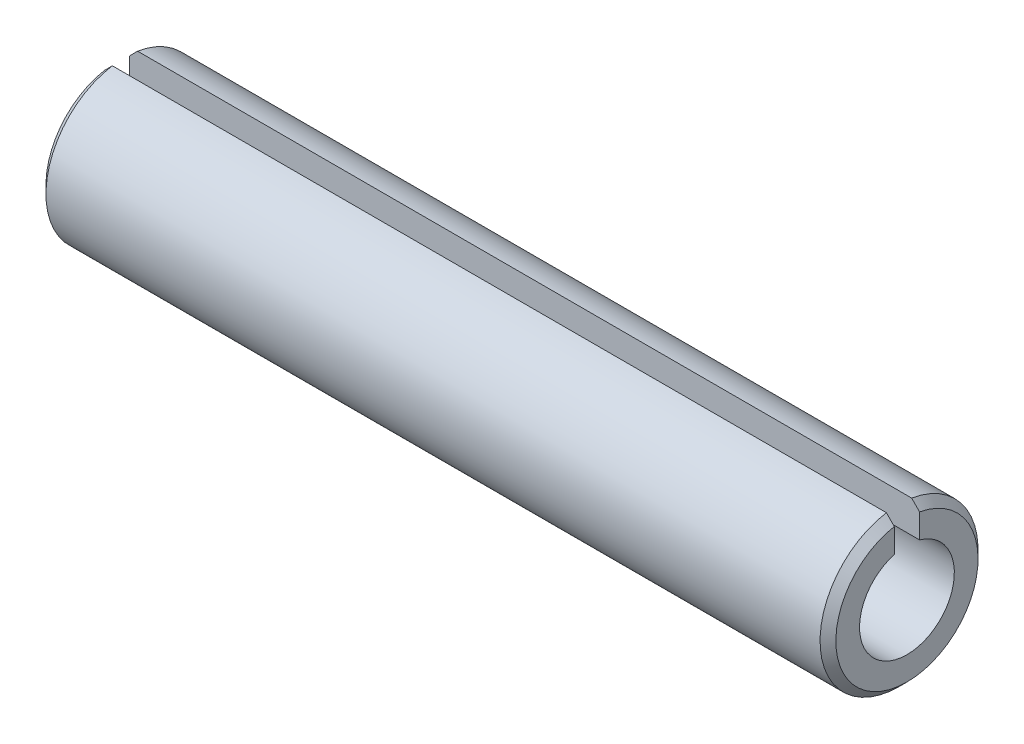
ISO-10303-21;
HEADER;
FILE_DESCRIPTION(('STEP AP214'),'2;1');
FILE_NAME('part.step','',(''),(''),'','','');
FILE_SCHEMA(('AUTOMOTIVE_DESIGN { 1 0 10303 214 1 1 1 1 }'));
ENDSEC;
DATA;
#1=APPLICATION_CONTEXT('core data for automotive mechanical design processes');
#2=APPLICATION_PROTOCOL_DEFINITION('international standard','automotive_design',2000,#1);
#3=PRODUCT_CONTEXT('',#1,'mechanical');
#4=PRODUCT('Part','Part','',(#3));
#5=PRODUCT_RELATED_PRODUCT_CATEGORY('part','',(#4));
#6=PRODUCT_DEFINITION_FORMATION('','',#4);
#7=PRODUCT_DEFINITION_CONTEXT('part definition',#1,'design');
#8=PRODUCT_DEFINITION('design','',#6,#7);
#9=PRODUCT_DEFINITION_SHAPE('','',#8);
#10=(LENGTH_UNIT() NAMED_UNIT(*) SI_UNIT(.MILLI.,.METRE.));
#11=(NAMED_UNIT(*) PLANE_ANGLE_UNIT() SI_UNIT($,.RADIAN.));
#12=(NAMED_UNIT(*) SI_UNIT($,.STERADIAN.) SOLID_ANGLE_UNIT());
#13=UNCERTAINTY_MEASURE_WITH_UNIT(LENGTH_MEASURE(1.E-05),#10,'distance_accuracy_value','');
#14=(GEOMETRIC_REPRESENTATION_CONTEXT(3) GLOBAL_UNCERTAINTY_ASSIGNED_CONTEXT((#13)) GLOBAL_UNIT_ASSIGNED_CONTEXT((#10,
#11,#12)) REPRESENTATION_CONTEXT('',''));
#15=CARTESIAN_POINT('',(0.,0.,0.));
#16=DIRECTION('',(0.,0.,1.));
#17=DIRECTION('',(1.,0.,0.));
#18=AXIS2_PLACEMENT_3D('',#15,#16,#17);
#19=CARTESIAN_POINT('',(0.,0.,0.));
#20=DIRECTION('',(-1.,0.,0.));
#21=DIRECTION('',(0.,0.,1.));
#22=AXIS2_PLACEMENT_3D('',#19,#20,#21);
#23=CYLINDRICAL_SURFACE('',#22,3.);
#24=DIRECTION('',(-1.,0.,0.));
#25=VECTOR('',#24,1.);
#26=CARTESIAN_POINT('',(50.0000000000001,2.89136645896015,0.800000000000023));
#27=LINE('',#26,#25);
#28=CARTESIAN_POINT('',(50.0000000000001,2.89136645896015,0.800000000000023));
#29=VERTEX_POINT('',#28);
#30=CARTESIAN_POINT('',(0.,2.89136645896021,0.800000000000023));
#31=VERTEX_POINT('',#30);
#32=EDGE_CURVE('E46',#29,#31,#27,.T.);
#33=ORIENTED_EDGE('',*,*,#32,.F.);
#34=CARTESIAN_POINT('',(50.,0.,0.));
#35=DIRECTION('',(-1.,0.,0.));
#36=DIRECTION('',(0.,0.,1.));
#37=AXIS2_PLACEMENT_3D('',#34,#35,#36);
#38=CIRCLE('',#37,3.);
#39=CARTESIAN_POINT('',(50.0000000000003,2.89136645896,-0.799999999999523));
#40=VERTEX_POINT('',#39);
#41=EDGE_CURVE('E88',#40,#29,#38,.T.);
#42=ORIENTED_EDGE('',*,*,#41,.F.);
#43=DIRECTION('',(-1.,0.,0.));
#44=VECTOR('',#43,1.);
#45=CARTESIAN_POINT('',(50.0000000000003,2.89136645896,-0.799999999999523));
#46=LINE('',#45,#44);
#47=CARTESIAN_POINT('',(0.,2.89136645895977,-0.799999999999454));
#48=VERTEX_POINT('',#47);
#49=EDGE_CURVE('E82',#40,#48,#46,.T.);
#50=ORIENTED_EDGE('',*,*,#49,.T.);
#51=CARTESIAN_POINT('',(0.,0.,0.));
#52=DIRECTION('',(-1.,0.,0.));
#53=DIRECTION('',(0.,0.,1.));
#54=AXIS2_PLACEMENT_3D('',#51,#52,#53);
#55=CIRCLE('',#54,3.);
#56=EDGE_CURVE('E92',#48,#31,#55,.T.);
#57=ORIENTED_EDGE('',*,*,#56,.T.);
#58=EDGE_LOOP('',(#33,#42,#50,#57));
#59=FACE_BOUND('',#58,.T.);
#60=ADVANCED_FACE('F32',(#59),#23,.F.);
#61=CARTESIAN_POINT('',(50.0000000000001,3.00000000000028,0.));
#62=DIRECTION('',(-1.,0.,0.));
#63=DIRECTION('',(0.,0.,1.));
#64=AXIS2_PLACEMENT_3D('',#61,#62,#63);
#65=PLANE('',#64);
#66=DIRECTION('',(0.,-1.00000000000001,0.));
#67=VECTOR('',#66,1.);
#68=CARTESIAN_POINT('',(50.0000000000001,4.93558507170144,0.800000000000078));
#69=LINE('',#68,#67);
#70=CARTESIAN_POINT('',(50.0000000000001,4.42831796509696,0.800000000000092));
#71=VERTEX_POINT('',#70);
#72=EDGE_CURVE('E123',#71,#29,#69,.T.);
#73=ORIENTED_EDGE('',*,*,#72,.F.);
#74=CARTESIAN_POINT('',(50.,0.,0.));
#75=DIRECTION('',(-1.,0.,0.));
#76=DIRECTION('',(0.,0.,1.));
#77=AXIS2_PLACEMENT_3D('',#74,#75,#76);
#78=CIRCLE('',#77,4.49999999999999);
#79=CARTESIAN_POINT('',(50.,4.42831796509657,-0.799999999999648));
#80=VERTEX_POINT('',#79);
#81=EDGE_CURVE('E116',#80,#71,#78,.T.);
#82=ORIENTED_EDGE('',*,*,#81,.F.);
#83=DIRECTION('',(0.,-1.00000000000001,0.));
#84=VECTOR('',#83,1.);
#85=CARTESIAN_POINT('',(50.,4.93558507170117,-0.799999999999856));
#86=LINE('',#85,#84);
#87=EDGE_CURVE('E124',#80,#40,#86,.T.);
#88=ORIENTED_EDGE('',*,*,#87,.T.);
#89=ORIENTED_EDGE('',*,*,#41,.T.);
#90=EDGE_LOOP('',(#73,#82,#88,#89));
#91=FACE_BOUND('',#90,.T.);
#92=ADVANCED_FACE('F121',(#91),#65,.F.);
#93=CARTESIAN_POINT('',(50.,0.,0.));
#94=DIRECTION('',(-1.,0.,0.));
#95=DIRECTION('',(0.,0.,1.));
#96=AXIS2_PLACEMENT_3D('',#93,#94,#95);
#97=CONICAL_SURFACE('',#96,4.49999999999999,0.785398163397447);
#98=CARTESIAN_POINT('',(46.9539691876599,7.50350458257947,0.800000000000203));
#99=CARTESIAN_POINT('',(47.1874569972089,7.26868587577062,0.800000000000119));
#100=CARTESIAN_POINT('',(47.4208900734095,7.03381265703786,0.80000000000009));
#101=CARTESIAN_POINT('',(47.8875863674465,6.56390102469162,0.800000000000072));
#102=CARTESIAN_POINT('',(48.120849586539,6.32886261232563,0.800000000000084));
#103=CARTESIAN_POINT('',(48.5871387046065,5.85857156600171,0.800000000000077));
#104=CARTESIAN_POINT('',(48.820164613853,5.62331894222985,0.800000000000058));
#105=CARTESIAN_POINT('',(49.2858912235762,5.15248819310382,0.800000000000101));
#106=CARTESIAN_POINT('',(49.5185919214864,4.91691006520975,0.800000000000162));
#107=CARTESIAN_POINT('',(49.9835143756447,4.44524699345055,0.800000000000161));
#108=CARTESIAN_POINT('',(50.2157360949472,4.20916201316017,0.8000000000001));
#109=CARTESIAN_POINT('',(50.6793839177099,3.7362190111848,0.800000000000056));
#110=CARTESIAN_POINT('',(50.9108100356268,3.49936100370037,0.800000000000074));
#111=CARTESIAN_POINT('',(51.2568839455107,3.14302145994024,0.800000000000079));
#112=CARTESIAN_POINT('',(51.3720686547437,3.02406172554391,0.800000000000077));
#113=CARTESIAN_POINT('',(51.6019251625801,2.78565001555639,0.800000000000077));
#114=CARTESIAN_POINT('',(51.71659696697,2.66619804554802,0.800000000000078));
#115=CARTESIAN_POINT('',(51.9452057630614,2.42657625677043,0.800000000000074));
#116=CARTESIAN_POINT('',(52.059142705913,2.30640639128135,0.800000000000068));
#117=CARTESIAN_POINT('',(52.2291821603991,2.12533337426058,0.80000000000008));
#118=CARTESIAN_POINT('',(52.2857187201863,2.06483817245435,0.800000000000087));
#119=CARTESIAN_POINT('',(52.3984122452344,1.94349384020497,0.800000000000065));
#120=CARTESIAN_POINT('',(52.4545692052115,1.88264470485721,0.800000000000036));
#121=CARTESIAN_POINT('',(52.5104904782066,1.82157847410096,0.799999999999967));
#122=B_SPLINE_CURVE_WITH_KNOTS('',3,(#98,#99,#100,#101,#102,#103,#104,#105,#106,#107,#108,#109,
#110,#111,#112,#113,#114,#115,#116,#117,#118,#119,#120,#121),.UNSPECIFIED.,.F.,.F.,(4,2,2,2,2,2,
2,2,2,2,2,4),(0.,0.993432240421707,1.98685705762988,2.9802368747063,3.97362448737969,
4.96708605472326,5.96052947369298,6.45728830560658,6.95404151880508,7.45082742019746,
7.69922983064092,7.9476356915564),.UNSPECIFIED.);
#123=CARTESIAN_POINT('',(49.5000000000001,4.93558507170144,0.800000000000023));
#124=VERTEX_POINT('',#123);
#125=EDGE_CURVE('E98',#124,#71,#122,.T.);
#126=ORIENTED_EDGE('',*,*,#125,.F.);
#127=CARTESIAN_POINT('',(49.5000000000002,2.77555756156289E-13,3.33066907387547E-13));
#128=DIRECTION('',(-1.,0.,0.));
#129=DIRECTION('',(0.,0.,1.));
#130=AXIS2_PLACEMENT_3D('',#127,#128,#129);
#131=CIRCLE('',#130,5.00000000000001);
#132=CARTESIAN_POINT('',(49.5000000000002,4.93558507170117,-0.799999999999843));
#133=VERTEX_POINT('',#132);
#134=EDGE_CURVE('E113',#133,#124,#131,.T.);
#135=ORIENTED_EDGE('',*,*,#134,.F.);
#136=CARTESIAN_POINT('',(46.95396918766,7.5035045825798,-0.799999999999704));
#137=CARTESIAN_POINT('',(47.1874569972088,7.26868587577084,-0.799999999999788));
#138=CARTESIAN_POINT('',(47.4208900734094,7.03381265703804,-0.799999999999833));
#139=CARTESIAN_POINT('',(47.8875863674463,6.56390102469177,-0.799999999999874));
#140=CARTESIAN_POINT('',(48.1208495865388,6.32886261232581,-0.79999999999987));
#141=CARTESIAN_POINT('',(48.5871387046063,5.85857156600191,-0.799999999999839));
#142=CARTESIAN_POINT('',(48.8201646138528,5.62331894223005,-0.799999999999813));
#143=CARTESIAN_POINT('',(49.285891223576,5.15248819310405,-0.799999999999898));
#144=CARTESIAN_POINT('',(49.5185919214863,4.91691006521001,-0.800000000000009));
#145=CARTESIAN_POINT('',(49.9835143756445,4.44524699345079,-0.800000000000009));
#146=CARTESIAN_POINT('',(50.215736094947,4.20916201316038,-0.799999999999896));
#147=CARTESIAN_POINT('',(50.6793839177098,3.73621901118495,-0.799999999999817));
#148=CARTESIAN_POINT('',(50.9108100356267,3.49936100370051,-0.79999999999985));
#149=CARTESIAN_POINT('',(51.2568839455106,3.14302145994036,-0.799999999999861));
#150=CARTESIAN_POINT('',(51.3720686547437,3.02406172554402,-0.799999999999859));
#151=CARTESIAN_POINT('',(51.60192516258,2.78565001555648,-0.799999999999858));
#152=CARTESIAN_POINT('',(51.71659696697,2.66619804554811,-0.799999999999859));
#153=CARTESIAN_POINT('',(51.9452057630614,2.4265762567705,-0.799999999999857));
#154=CARTESIAN_POINT('',(52.059142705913,2.30640639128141,-0.799999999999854));
#155=CARTESIAN_POINT('',(52.2291821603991,2.12533337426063,-0.799999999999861));
#156=CARTESIAN_POINT('',(52.2857187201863,2.06483817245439,-0.799999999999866));
#157=CARTESIAN_POINT('',(52.3984122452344,1.94349384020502,-0.799999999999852));
#158=CARTESIAN_POINT('',(52.4545692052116,1.88264470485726,-0.799999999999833));
#159=CARTESIAN_POINT('',(52.5104904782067,1.82157847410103,-0.799999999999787));
#160=B_SPLINE_CURVE_WITH_KNOTS('',3,(#136,#137,#138,#139,#140,#141,#142,#143,#144,#145,#146,
#147,#148,#149,#150,#151,#152,#153,#154,#155,#156,#157,#158,#159),.UNSPECIFIED.,.F.,.F.,(4,2,2,
2,2,2,2,2,2,2,2,4),(0.,0.993432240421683,1.98685705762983,2.98023687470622,3.97362448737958,
4.96708605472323,5.96052947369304,6.45728830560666,6.95404151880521,7.45082742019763,
7.69922983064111,7.94763569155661),.UNSPECIFIED.);
#161=EDGE_CURVE('E140',#133,#80,#160,.T.);
#162=ORIENTED_EDGE('',*,*,#161,.T.);
#163=ORIENTED_EDGE('',*,*,#81,.T.);
#164=EDGE_LOOP('',(#126,#135,#162,#163));
#165=FACE_BOUND('',#164,.T.);
#166=ADVANCED_FACE('F162',(#165),#97,.T.);
#167=CARTESIAN_POINT('',(0.,0.,0.));
#168=DIRECTION('',(-1.,0.,0.));
#169=DIRECTION('',(0.,0.,1.));
#170=AXIS2_PLACEMENT_3D('',#167,#168,#169);
#171=CYLINDRICAL_SURFACE('',#170,5.);
#172=DIRECTION('',(-1.,0.,0.));
#173=VECTOR('',#172,1.);
#174=CARTESIAN_POINT('',(50.0000000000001,4.93558507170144,0.800000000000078));
#175=LINE('',#174,#173);
#176=CARTESIAN_POINT('',(0.500000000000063,4.93558507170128,0.800000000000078));
#177=VERTEX_POINT('',#176);
#178=EDGE_CURVE('E131',#124,#177,#175,.T.);
#179=ORIENTED_EDGE('',*,*,#178,.T.);
#180=CARTESIAN_POINT('',(0.500000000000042,0.,0.));
#181=DIRECTION('',(-1.,0.,0.));
#182=DIRECTION('',(0.,0.,1.));
#183=AXIS2_PLACEMENT_3D('',#180,#181,#182);
#184=CIRCLE('',#183,5.);
#185=CARTESIAN_POINT('',(0.500000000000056,4.93558507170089,-0.799999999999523));
#186=VERTEX_POINT('',#185);
#187=EDGE_CURVE('E100',#186,#177,#184,.T.);
#188=ORIENTED_EDGE('',*,*,#187,.F.);
#189=DIRECTION('',(-1.,0.,0.));
#190=VECTOR('',#189,1.);
#191=CARTESIAN_POINT('',(50.,4.93558507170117,-0.799999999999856));
#192=LINE('',#191,#190);
#193=EDGE_CURVE('E94',#133,#186,#192,.T.);
#194=ORIENTED_EDGE('',*,*,#193,.F.);
#195=ORIENTED_EDGE('',*,*,#134,.T.);
#196=EDGE_LOOP('',(#179,#188,#194,#195));
#197=FACE_BOUND('',#196,.T.);
#198=ADVANCED_FACE('F166',(#197),#171,.T.);
#199=CARTESIAN_POINT('',(0.500000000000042,0.,0.));
#200=DIRECTION('',(1.,0.,0.));
#201=DIRECTION('',(0.,0.,-1.));
#202=AXIS2_PLACEMENT_3D('',#199,#200,#201);
#203=CONICAL_SURFACE('',#202,5.,0.785398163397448);
#204=CARTESIAN_POINT('',(-2.51049047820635,1.8215784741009,0.800000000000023));
#205=CARTESIAN_POINT('',(-2.44487423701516,1.89322296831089,0.800000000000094));
#206=CARTESIAN_POINT('',(-2.37894001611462,1.96457424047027,0.800000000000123));
#207=CARTESIAN_POINT('',(-2.24657065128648,2.1068084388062,0.800000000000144));
#208=CARTESIAN_POINT('',(-2.18013551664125,2.177691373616,0.800000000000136));
#209=CARTESIAN_POINT('',(-2.0468998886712,2.3191064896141,0.80000000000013));
#210=CARTESIAN_POINT('',(-1.98009941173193,2.38963868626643,0.800000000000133));
#211=CARTESIAN_POINT('',(-1.84621023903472,2.5304295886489,0.800000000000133));
#212=CARTESIAN_POINT('',(-1.77912154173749,2.60068829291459,0.800000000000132));
#213=CARTESIAN_POINT('',(-1.57752969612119,2.81113219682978,0.800000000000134));
#214=CARTESIAN_POINT('',(-1.4426908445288,2.95099570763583,0.800000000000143));
#215=CARTESIAN_POINT('',(-1.1724295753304,3.23016011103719,0.800000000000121));
#216=CARTESIAN_POINT('',(-1.03700715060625,3.36946099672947,0.80000000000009));
#217=CARTESIAN_POINT('',(-0.710274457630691,3.70458249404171,0.800000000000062));
#218=CARTESIAN_POINT('',(-0.518766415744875,3.90021021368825,0.800000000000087));
#219=CARTESIAN_POINT('',(-0.135243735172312,4.290976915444,0.800000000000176));
#220=CARTESIAN_POINT('',(0.0567709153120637,4.48611588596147,0.800000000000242));
#221=CARTESIAN_POINT('',(0.481419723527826,4.91692244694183,0.800000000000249));
#222=CARTESIAN_POINT('',(0.71413258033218,5.15251244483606,0.800000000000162));
#223=CARTESIAN_POINT('',(1.17988513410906,5.62336904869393,0.800000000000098));
#224=CARTESIAN_POINT('',(1.41292483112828,5.85863565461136,0.800000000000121));
#225=CARTESIAN_POINT('',(1.87921588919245,6.32892864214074,0.800000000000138));
#226=CARTESIAN_POINT('',(2.11246723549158,6.56395503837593,0.800000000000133));
#227=CARTESIAN_POINT('',(2.57913776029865,7.03384064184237,0.800000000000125));
#228=CARTESIAN_POINT('',(2.81255693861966,7.26869984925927,0.800000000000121));
#229=CARTESIAN_POINT('',(3.04603081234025,7.50350458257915,0.800000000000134));
#230=B_SPLINE_CURVE_WITH_KNOTS('',3,(#204,#205,#206,#207,#208,#209,#210,#211,#212,#213,#214,
#215,#216,#217,#218,#219,#220,#221,#222,#223,#224,#225,#226,#227,#228,#229),.UNSPECIFIED.,.F.,
.F.,(4,2,2,2,2,2,2,2,2,2,2,2,4),(0.,0.291451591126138,0.582897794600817,0.874331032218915,
1.16576582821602,1.74859198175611,2.33142526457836,3.15270907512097,3.97401218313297,
4.96745076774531,5.96088949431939,6.95426363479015,7.9476366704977),.UNSPECIFIED.);
#231=CARTESIAN_POINT('',(0.,4.42831796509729,0.800000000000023));
#232=VERTEX_POINT('',#231);
#233=EDGE_CURVE('E102',#232,#177,#230,.T.);
#234=ORIENTED_EDGE('',*,*,#233,.F.);
#235=CARTESIAN_POINT('',(0.,0.,0.));
#236=DIRECTION('',(-1.,0.,0.));
#237=DIRECTION('',(0.,0.,1.));
#238=AXIS2_PLACEMENT_3D('',#235,#236,#237);
#239=CIRCLE('',#238,4.49999999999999);
#240=CARTESIAN_POINT('',(0.,4.42831796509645,-0.799999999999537));
#241=VERTEX_POINT('',#240);
#242=EDGE_CURVE('E97',#241,#232,#239,.T.);
#243=ORIENTED_EDGE('',*,*,#242,.F.);
#244=CARTESIAN_POINT('',(-2.51049047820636,1.82157847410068,-0.79999999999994));
#245=CARTESIAN_POINT('',(-2.44487423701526,1.89322296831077,-0.799999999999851));
#246=CARTESIAN_POINT('',(-2.37894001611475,1.9645742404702,-0.799999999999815));
#247=CARTESIAN_POINT('',(-2.24657065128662,2.10680843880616,-0.799999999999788));
#248=CARTESIAN_POINT('',(-2.18013551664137,2.17769137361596,-0.799999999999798));
#249=CARTESIAN_POINT('',(-2.0468998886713,2.31910648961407,-0.799999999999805));
#250=CARTESIAN_POINT('',(-1.98009941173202,2.38963868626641,-0.799999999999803));
#251=CARTESIAN_POINT('',(-1.84621023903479,2.53042958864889,-0.7999999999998));
#252=CARTESIAN_POINT('',(-1.77912154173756,2.60068829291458,-0.799999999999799));
#253=CARTESIAN_POINT('',(-1.57752969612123,2.8111321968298,-0.799999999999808));
#254=CARTESIAN_POINT('',(-1.44269084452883,2.95099570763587,-0.799999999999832));
#255=CARTESIAN_POINT('',(-1.17242957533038,3.23016011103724,-0.799999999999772));
#256=CARTESIAN_POINT('',(-1.03700715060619,3.36946099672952,-0.799999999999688));
#257=CARTESIAN_POINT('',(-0.710274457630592,3.70458249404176,-0.799999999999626));
#258=CARTESIAN_POINT('',(-0.518766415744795,3.90021021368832,-0.799999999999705));
#259=CARTESIAN_POINT('',(-0.135243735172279,4.29097691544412,-0.799999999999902));
#260=CARTESIAN_POINT('',(0.0567709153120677,4.48611588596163,-0.800000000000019));
#261=CARTESIAN_POINT('',(0.481419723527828,4.91692244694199,-0.800000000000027));
#262=CARTESIAN_POINT('',(0.714132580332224,5.15251244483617,-0.799999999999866));
#263=CARTESIAN_POINT('',(1.17988513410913,5.623369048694,-0.799999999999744));
#264=CARTESIAN_POINT('',(1.41292483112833,5.85863565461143,-0.799999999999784));
#265=CARTESIAN_POINT('',(1.87921588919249,6.32892864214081,-0.799999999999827));
#266=CARTESIAN_POINT('',(2.11246723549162,6.56395503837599,-0.799999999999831));
#267=CARTESIAN_POINT('',(2.57913776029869,7.03384064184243,-0.799999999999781));
#268=CARTESIAN_POINT('',(2.81255693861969,7.26869984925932,-0.799999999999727));
#269=CARTESIAN_POINT('',(3.04603081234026,7.5035045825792,-0.799999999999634));
#270=B_SPLINE_CURVE_WITH_KNOTS('',3,(#244,#245,#246,#247,#248,#249,#250,#251,#252,#253,#254,
#255,#256,#257,#258,#259,#260,#261,#262,#263,#264,#265,#266,#267,#268,#269),.UNSPECIFIED.,.F.,
.F.,(4,2,2,2,2,2,2,2,2,2,2,2,4),(0.,0.291451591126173,0.582897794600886,0.874331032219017,
1.16576582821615,1.74859198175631,2.33142526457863,3.15270907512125,3.97401218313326,
4.96745076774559,5.96088949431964,6.95426363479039,7.94763667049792),.UNSPECIFIED.);
#271=EDGE_CURVE('E53',#241,#186,#270,.T.);
#272=ORIENTED_EDGE('',*,*,#271,.T.);
#273=ORIENTED_EDGE('',*,*,#187,.T.);
#274=EDGE_LOOP('',(#234,#243,#272,#273));
#275=FACE_BOUND('',#274,.T.);
#276=ADVANCED_FACE('F144',(#275),#203,.T.);
#277=CARTESIAN_POINT('',(0.,3.00000000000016,0.));
#278=DIRECTION('',(-1.,0.,0.));
#279=DIRECTION('',(0.,0.,1.));
#280=AXIS2_PLACEMENT_3D('',#277,#278,#279);
#281=PLANE('',#280);
#282=ORIENTED_EDGE('',*,*,#242,.T.);
#283=DIRECTION('',(0.,-1.00000000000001,0.));
#284=VECTOR('',#283,1.);
#285=CARTESIAN_POINT('',(0.,3.00000000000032,0.800000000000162));
#286=LINE('',#285,#284);
#287=EDGE_CURVE('E11',#232,#31,#286,.T.);
#288=ORIENTED_EDGE('',*,*,#287,.T.);
#289=ORIENTED_EDGE('',*,*,#56,.F.);
#290=DIRECTION('',(0.,-1.00000000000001,0.));
#291=VECTOR('',#290,1.);
#292=CARTESIAN_POINT('',(0.,3.00000000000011,-0.800000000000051));
#293=LINE('',#292,#291);
#294=EDGE_CURVE('E39',#241,#48,#293,.T.);
#295=ORIENTED_EDGE('',*,*,#294,.F.);
#296=EDGE_LOOP('',(#282,#288,#289,#295));
#297=FACE_BOUND('',#296,.T.);
#298=ADVANCED_FACE('F96',(#297),#281,.T.);
#299=CARTESIAN_POINT('',(50.,4.93558507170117,-0.799999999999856));
#300=DIRECTION('',(0.,0.,-1.));
#301=DIRECTION('',(0.,1.00000000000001,0.));
#302=AXIS2_PLACEMENT_3D('',#299,#300,#301);
#303=PLANE('',#302);
#304=ORIENTED_EDGE('',*,*,#193,.T.);
#305=ORIENTED_EDGE('',*,*,#271,.F.);
#306=ORIENTED_EDGE('',*,*,#294,.T.);
#307=ORIENTED_EDGE('',*,*,#49,.F.);
#308=ORIENTED_EDGE('',*,*,#87,.F.);
#309=ORIENTED_EDGE('',*,*,#161,.F.);
#310=EDGE_LOOP('',(#304,#305,#306,#307,#308,#309));
#311=FACE_BOUND('',#310,.T.);
#312=ADVANCED_FACE('F81',(#311),#303,.F.);
#313=CARTESIAN_POINT('',(50.0000000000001,4.93558507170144,0.800000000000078));
#314=DIRECTION('',(0.,0.,-1.));
#315=DIRECTION('',(0.,1.00000000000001,0.));
#316=AXIS2_PLACEMENT_3D('',#313,#314,#315);
#317=PLANE('',#316);
#318=ORIENTED_EDGE('',*,*,#125,.T.);
#319=ORIENTED_EDGE('',*,*,#72,.T.);
#320=ORIENTED_EDGE('',*,*,#32,.T.);
#321=ORIENTED_EDGE('',*,*,#287,.F.);
#322=ORIENTED_EDGE('',*,*,#233,.T.);
#323=ORIENTED_EDGE('',*,*,#178,.F.);
#324=EDGE_LOOP('',(#318,#319,#320,#321,#322,#323));
#325=FACE_BOUND('',#324,.T.);
#326=ADVANCED_FACE('F150',(#325),#317,.T.);
#327=CLOSED_SHELL('',(#60,#92,#166,#198,#276,#298,#312,#326));
#328=MANIFOLD_SOLID_BREP('B2',#327);
#329=ADVANCED_BREP_SHAPE_REPRESENTATION('',(#18,#328),#14);
#330=SHAPE_DEFINITION_REPRESENTATION(#9,#329);
ENDSEC;
END-ISO-10303-21;
